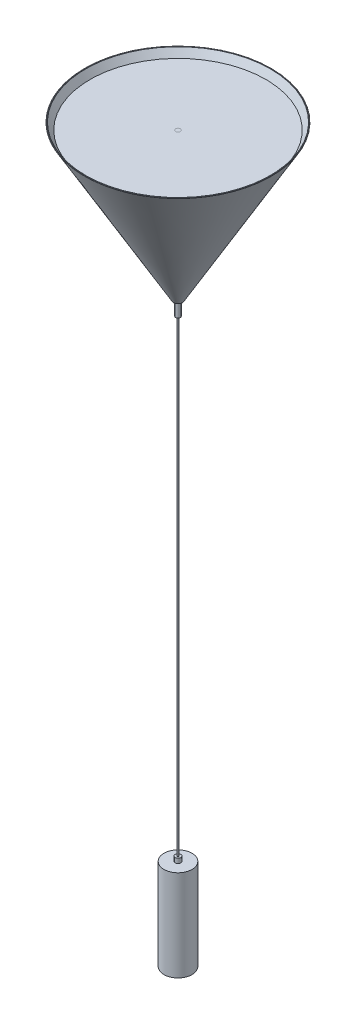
ISO-10303-21;
HEADER;
FILE_DESCRIPTION(('STEP AP214'),'2;1');
FILE_NAME('part.step','',(''),(''),'','','');
FILE_SCHEMA(('AUTOMOTIVE_DESIGN { 1 0 10303 214 1 1 1 1 }'));
ENDSEC;
DATA;
#1=APPLICATION_CONTEXT('core data for automotive mechanical design processes');
#2=APPLICATION_PROTOCOL_DEFINITION('international standard','automotive_design',2000,#1);
#3=PRODUCT_CONTEXT('',#1,'mechanical');
#4=PRODUCT('Part','Part','',(#3));
#5=PRODUCT_RELATED_PRODUCT_CATEGORY('part','',(#4));
#6=PRODUCT_DEFINITION_FORMATION('','',#4);
#7=PRODUCT_DEFINITION_CONTEXT('part definition',#1,'design');
#8=PRODUCT_DEFINITION('design','',#6,#7);
#9=PRODUCT_DEFINITION_SHAPE('','',#8);
#10=(LENGTH_UNIT() NAMED_UNIT(*) SI_UNIT(.MILLI.,.METRE.));
#11=(NAMED_UNIT(*) PLANE_ANGLE_UNIT() SI_UNIT($,.RADIAN.));
#12=(NAMED_UNIT(*) SI_UNIT($,.STERADIAN.) SOLID_ANGLE_UNIT());
#13=UNCERTAINTY_MEASURE_WITH_UNIT(LENGTH_MEASURE(1.E-05),#10,'distance_accuracy_value','');
#14=(GEOMETRIC_REPRESENTATION_CONTEXT(3) GLOBAL_UNCERTAINTY_ASSIGNED_CONTEXT((#13)) GLOBAL_UNIT_ASSIGNED_CONTEXT((#10,
#11,#12)) REPRESENTATION_CONTEXT('',''));
#15=CARTESIAN_POINT('',(0.,0.,0.));
#16=DIRECTION('',(0.,0.,1.));
#17=DIRECTION('',(1.,0.,0.));
#18=AXIS2_PLACEMENT_3D('',#15,#16,#17);
#19=CARTESIAN_POINT('',(-136.005486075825,491.550601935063,408.036497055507));
#20=DIRECTION('',(0.,1.,0.));
#21=DIRECTION('',(0.837169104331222,0.,0.546944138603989));
#22=AXIS2_PLACEMENT_3D('',#19,#20,#21);
#23=PLANE('',#22);
#24=CARTESIAN_POINT('',(-136.005486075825,491.550601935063,408.036497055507));
#25=DIRECTION('',(0.,1.,0.));
#26=DIRECTION('',(0.837169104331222,0.,0.546944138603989));
#27=AXIS2_PLACEMENT_3D('',#24,#25,#26);
#28=CIRCLE('',#27,186.845299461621);
#29=CARTESIAN_POINT('',(20.4156259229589,491.550601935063,510.230438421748));
#30=VERTEX_POINT('',#29);
#31=EDGE_CURVE('P0_E10',#30,#30,#28,.T.);
#32=ORIENTED_EDGE('',*,*,#31,.F.);
#33=EDGE_LOOP('',(#32));
#34=FACE_BOUND('',#33,.T.);
#35=ADVANCED_FACE('P0_F15',(#34),#23,.F.);
#36=CARTESIAN_POINT('',(-136.005486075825,491.550601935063,408.036497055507));
#37=DIRECTION('',(0.,1.,0.));
#38=DIRECTION('',(0.837169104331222,0.,0.546944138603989));
#39=AXIS2_PLACEMENT_3D('',#36,#37,#38);
#40=CONICAL_SURFACE('',#39,186.845299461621,0.523598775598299);
#41=CARTESIAN_POINT('',(-136.005486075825,493.550601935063,408.036497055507));
#42=DIRECTION('',(0.,1.,0.));
#43=DIRECTION('',(0.837169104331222,0.,0.546944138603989));
#44=AXIS2_PLACEMENT_3D('',#41,#42,#43);
#45=CIRCLE('',#44,188.);
#46=CARTESIAN_POINT('',(21.3823055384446,493.550601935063,510.861995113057));
#47=VERTEX_POINT('',#46);
#48=EDGE_CURVE('P0_E21',#47,#47,#45,.T.);
#49=ORIENTED_EDGE('',*,*,#48,.F.);
#50=EDGE_LOOP('',(#49));
#51=FACE_BOUND('',#50,.T.);
#52=ORIENTED_EDGE('',*,*,#31,.T.);
#53=EDGE_LOOP('',(#52));
#54=FACE_BOUND('',#53,.T.);
#55=ADVANCED_FACE('P0_F29',(#51,#54),#40,.T.);
#56=CARTESIAN_POINT('',(-293.393277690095,493.550601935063,305.210998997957));
#57=DIRECTION('',(0.,-1.,0.));
#58=DIRECTION('',(-0.837169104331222,0.,-0.546944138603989));
#59=AXIS2_PLACEMENT_3D('',#56,#57,#58);
#60=PLANE('',#59);
#61=ORIENTED_EDGE('',*,*,#48,.T.);
#62=EDGE_LOOP('',(#61));
#63=FACE_BOUND('',#62,.T.);
#64=ADVANCED_FACE('P0_F27',(#63),#60,.F.);
#65=CLOSED_SHELL('',(#35,#55,#64));
#66=MANIFOLD_SOLID_BREP('P0_B1',#65);
#67=CARTESIAN_POINT('',(-136.005486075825,148.636246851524,408.036497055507));
#68=DIRECTION('',(0.,1.,0.));
#69=DIRECTION('',(-0.546944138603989,0.,0.837169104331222));
#70=AXIS2_PLACEMENT_3D('',#67,#68,#69);
#71=CYLINDRICAL_SURFACE('',#70,5.);
#72=CARTESIAN_POINT('',(-136.005486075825,148.636246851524,408.036497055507));
#73=DIRECTION('',(0.,-1.,0.));
#74=DIRECTION('',(0.546944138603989,0.,-0.837169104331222));
#75=AXIS2_PLACEMENT_3D('',#72,#73,#74);
#76=CIRCLE('',#75,5.);
#77=CARTESIAN_POINT('',(-133.270765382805,148.636246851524,403.850651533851));
#78=VERTEX_POINT('',#77);
#79=EDGE_CURVE('P1_E10',#78,#78,#76,.T.);
#80=ORIENTED_EDGE('',*,*,#79,.F.);
#81=EDGE_LOOP('',(#80));
#82=FACE_BOUND('',#81,.T.);
#83=CARTESIAN_POINT('',(-136.005486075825,178.636246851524,408.036497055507));
#84=DIRECTION('',(0.,-1.,0.));
#85=DIRECTION('',(0.546944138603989,0.,-0.837169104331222));
#86=AXIS2_PLACEMENT_3D('',#83,#84,#85);
#87=CIRCLE('',#86,5.);
#88=CARTESIAN_POINT('',(-133.270765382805,178.636246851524,403.850651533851));
#89=VERTEX_POINT('',#88);
#90=EDGE_CURVE('P1_E18',#89,#89,#87,.T.);
#91=ORIENTED_EDGE('',*,*,#90,.T.);
#92=EDGE_LOOP('',(#91));
#93=FACE_BOUND('',#92,.T.);
#94=ADVANCED_FACE('P1_F15',(#82,#93),#71,.T.);
#95=CARTESIAN_POINT('',(-136.005486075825,148.636246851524,408.036497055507));
#96=DIRECTION('',(0.,-1.,0.));
#97=DIRECTION('',(0.546944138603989,0.,-0.837169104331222));
#98=AXIS2_PLACEMENT_3D('',#95,#96,#97);
#99=PLANE('',#98);
#100=ORIENTED_EDGE('',*,*,#79,.T.);
#101=EDGE_LOOP('',(#100));
#102=FACE_BOUND('',#101,.T.);
#103=ADVANCED_FACE('P1_F30',(#102),#99,.T.);
#104=CARTESIAN_POINT('',(-136.005486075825,178.636246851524,408.036497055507));
#105=DIRECTION('',(0.,-1.,0.));
#106=DIRECTION('',(0.546944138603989,0.,-0.837169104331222));
#107=AXIS2_PLACEMENT_3D('',#104,#105,#106);
#108=PLANE('',#107);
#109=ORIENTED_EDGE('',*,*,#90,.F.);
#110=EDGE_LOOP('',(#109));
#111=FACE_BOUND('',#110,.T.);
#112=ADVANCED_FACE('P1_F28',(#111),#108,.F.);
#113=CLOSED_SHELL('',(#94,#103,#112));
#114=MANIFOLD_SOLID_BREP('P1_B1',#113);
#115=CARTESIAN_POINT('',(-136.005486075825,178.636246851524,408.036497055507));
#116=DIRECTION('',(0.,1.,0.));
#117=DIRECTION('',(-0.546944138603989,0.,0.837169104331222));
#118=AXIS2_PLACEMENT_3D('',#115,#116,#117);
#119=PLANE('',#118);
#120=CARTESIAN_POINT('',(-136.005486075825,178.636246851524,408.036497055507));
#121=DIRECTION('',(0.,1.,0.));
#122=DIRECTION('',(-0.546944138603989,0.,0.837169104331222));
#123=AXIS2_PLACEMENT_3D('',#120,#121,#122);
#124=CIRCLE('',#123,9.52385828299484);
#125=CARTESIAN_POINT('',(-141.214504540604,178.636246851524,416.00957696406));
#126=VERTEX_POINT('',#125);
#127=EDGE_CURVE('P2_E35',#126,#126,#124,.T.);
#128=ORIENTED_EDGE('',*,*,#127,.F.);
#129=EDGE_LOOP('',(#128));
#130=FACE_BOUND('',#129,.T.);
#131=ADVANCED_FACE('P2_F15',(#130),#119,.F.);
#132=CARTESIAN_POINT('',(-136.005486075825,178.636246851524,408.036497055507));
#133=DIRECTION('',(0.,1.,0.));
#134=DIRECTION('',(-0.546944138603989,0.,0.837169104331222));
#135=AXIS2_PLACEMENT_3D('',#132,#133,#134);
#136=CONICAL_SURFACE('',#135,9.52385828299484,0.523598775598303);
#137=CARTESIAN_POINT('',(-136.005486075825,507.800601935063,408.036497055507));
#138=DIRECTION('',(0.,-1.,0.));
#139=DIRECTION('',(0.546944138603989,0.,-0.837169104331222));
#140=AXIS2_PLACEMENT_3D('',#137,#138,#139);
#141=CIRCLE('',#140,199.566987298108);
#142=CARTESIAN_POINT('',(-245.157480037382,507.800601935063,575.107813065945));
#143=VERTEX_POINT('',#142);
#144=EDGE_CURVE('P2_E22',#143,#143,#141,.T.);
#145=CARTESIAN_POINT('',(-245.157480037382,507.800601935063,575.107813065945));
#146=CARTESIAN_POINT('',(-244.07474070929,504.37180656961,573.450539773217));
#147=CARTESIAN_POINT('',(-242.992001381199,500.943011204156,571.793266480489));
#148=CARTESIAN_POINT('',(-240.826522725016,494.085420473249,568.478719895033));
#149=CARTESIAN_POINT('',(-239.743783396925,490.656625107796,566.821446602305));
#150=CARTESIAN_POINT('',(-237.578304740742,483.799034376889,563.506900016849));
#151=CARTESIAN_POINT('',(-236.49556541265,480.370239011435,561.849626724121));
#152=CARTESIAN_POINT('',(-234.330086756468,473.512648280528,558.535080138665));
#153=CARTESIAN_POINT('',(-233.247347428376,470.083852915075,556.877806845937));
#154=CARTESIAN_POINT('',(-231.081868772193,463.226262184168,553.563260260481));
#155=CARTESIAN_POINT('',(-229.999129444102,459.797466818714,551.905986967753));
#156=CARTESIAN_POINT('',(-227.833650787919,452.939876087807,548.591440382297));
#157=CARTESIAN_POINT('',(-226.750911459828,449.511080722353,546.934167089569));
#158=CARTESIAN_POINT('',(-224.585432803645,442.653489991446,543.619620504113));
#159=CARTESIAN_POINT('',(-223.502693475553,439.224694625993,541.962347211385));
#160=CARTESIAN_POINT('',(-221.33721481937,432.367103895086,538.647800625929));
#161=CARTESIAN_POINT('',(-220.254475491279,428.938308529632,536.990527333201));
#162=CARTESIAN_POINT('',(-218.088996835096,422.080717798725,533.675980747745));
#163=CARTESIAN_POINT('',(-217.006257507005,418.651922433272,532.018707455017));
#164=CARTESIAN_POINT('',(-214.840778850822,411.794331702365,528.704160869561));
#165=CARTESIAN_POINT('',(-213.75803952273,408.365536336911,527.046887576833));
#166=CARTESIAN_POINT('',(-211.592560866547,401.507945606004,523.732340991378));
#167=CARTESIAN_POINT('',(-210.509821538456,398.07915024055,522.075067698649));
#168=CARTESIAN_POINT('',(-208.344342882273,391.221559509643,518.760521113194));
#169=CARTESIAN_POINT('',(-207.261603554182,387.79276414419,517.103247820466));
#170=CARTESIAN_POINT('',(-205.096124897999,380.935173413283,513.78870123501));
#171=CARTESIAN_POINT('',(-204.013385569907,377.506378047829,512.131427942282));
#172=CARTESIAN_POINT('',(-201.847906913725,370.648787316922,508.816881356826));
#173=CARTESIAN_POINT('',(-200.765167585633,367.219991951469,507.159608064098));
#174=CARTESIAN_POINT('',(-198.59968892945,360.362401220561,503.845061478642));
#175=CARTESIAN_POINT('',(-197.516949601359,356.933605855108,502.187788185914));
#176=CARTESIAN_POINT('',(-195.351470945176,350.076015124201,498.873241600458));
#177=CARTESIAN_POINT('',(-194.268731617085,346.647219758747,497.21596830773));
#178=CARTESIAN_POINT('',(-192.103252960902,339.78962902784,493.901421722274));
#179=CARTESIAN_POINT('',(-191.02051363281,336.360833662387,492.244148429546));
#180=CARTESIAN_POINT('',(-188.855034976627,329.50324293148,488.92960184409));
#181=CARTESIAN_POINT('',(-187.772295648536,326.074447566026,487.272328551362));
#182=CARTESIAN_POINT('',(-185.606816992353,319.216856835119,483.957781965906));
#183=CARTESIAN_POINT('',(-184.524077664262,315.788061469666,482.300508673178));
#184=CARTESIAN_POINT('',(-182.358599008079,308.930470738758,478.985962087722));
#185=CARTESIAN_POINT('',(-181.275859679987,305.501675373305,477.328688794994));
#186=CARTESIAN_POINT('',(-179.110381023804,298.644084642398,474.014142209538));
#187=CARTESIAN_POINT('',(-178.027641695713,295.215289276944,472.356868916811));
#188=CARTESIAN_POINT('',(-175.86216303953,288.357698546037,469.042322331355));
#189=CARTESIAN_POINT('',(-174.779423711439,284.928903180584,467.385049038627));
#190=CARTESIAN_POINT('',(-172.613945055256,278.071312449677,464.070502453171));
#191=CARTESIAN_POINT('',(-171.531205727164,274.642517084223,462.413229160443));
#192=CARTESIAN_POINT('',(-169.365727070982,267.784926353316,459.098682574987));
#193=CARTESIAN_POINT('',(-168.28298774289,264.356130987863,457.441409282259));
#194=CARTESIAN_POINT('',(-166.117509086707,257.498540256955,454.126862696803));
#195=CARTESIAN_POINT('',(-165.034769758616,254.069744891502,452.469589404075));
#196=CARTESIAN_POINT('',(-162.869291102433,247.212154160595,449.155042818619));
#197=CARTESIAN_POINT('',(-161.786551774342,243.783358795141,447.497769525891));
#198=CARTESIAN_POINT('',(-159.621073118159,236.925768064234,444.183222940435));
#199=CARTESIAN_POINT('',(-158.538333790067,233.496972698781,442.525949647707));
#200=CARTESIAN_POINT('',(-156.372855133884,226.639381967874,439.211403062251));
#201=CARTESIAN_POINT('',(-155.290115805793,223.21058660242,437.554129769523));
#202=CARTESIAN_POINT('',(-153.12463714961,216.352995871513,434.239583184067));
#203=CARTESIAN_POINT('',(-152.041897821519,212.924200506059,432.582309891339));
#204=CARTESIAN_POINT('',(-149.876419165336,206.066609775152,429.267763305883));
#205=CARTESIAN_POINT('',(-148.793679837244,202.637814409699,427.610490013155));
#206=CARTESIAN_POINT('',(-146.628201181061,195.780223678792,424.295943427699));
#207=CARTESIAN_POINT('',(-145.54546185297,192.351428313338,422.638670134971));
#208=CARTESIAN_POINT('',(-143.379983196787,185.493837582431,419.324123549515));
#209=CARTESIAN_POINT('',(-142.297243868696,182.065042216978,417.666850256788));
#210=CARTESIAN_POINT('',(-141.214504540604,178.636246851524,416.00957696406));
#211=B_SPLINE_CURVE_WITH_KNOTS('',3,(#145,#146,#147,#148,#149,#150,#151,#152,#153,#154,#155,
#156,#157,#158,#159,#160,#161,#162,#163,#164,#165,#166,#167,#168,#169,#170,#171,#172,#173,#174,
#175,#176,#177,#178,#179,#180,#181,#182,#183,#184,#185,#186,#187,#188,#189,#190,#191,#192,#193,
#194,#195,#196,#197,#198,#199,#200,#201,#202,#203,#204,#205,#206,#207,#208,#209,#210),
.UNSPECIFIED.,.F.,.F.,(4,2,2,2,2,2,2,2,2,2,2,2,2,2,2,2,2,2,2,2,2,2,2,2,2,2,2,2,2,2,2,2,4),(0.,
11.8776955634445,23.7553911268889,35.6330866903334,47.5107822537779,59.3884778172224,
71.2661733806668,83.1438689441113,95.0215645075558,106.899260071,118.776955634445,
130.654651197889,142.532346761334,154.410042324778,166.287737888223,178.165433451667,
190.043129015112,201.920824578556,213.798520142,225.676215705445,237.553911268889,
249.431606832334,261.309302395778,273.186997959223,285.064693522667,296.942389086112,
308.820084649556,320.697780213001,332.575475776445,344.45317133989,356.330866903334,
368.208562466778,380.086258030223),.UNSPECIFIED.);
#212=EDGE_CURVE('P2_BSEAM58',#143,#126,#211,.T.);
#213=ORIENTED_EDGE('',*,*,#144,.T.);
#214=ORIENTED_EDGE('',*,*,#127,.T.);
#215=ORIENTED_EDGE('',*,*,#212,.T.);
#216=ORIENTED_EDGE('',*,*,#212,.F.);
#217=EDGE_LOOP('',(#213,#215,#214,#216));
#218=FACE_BOUND('',#217,.T.);
#219=ADVANCED_FACE('P2_F58',(#218),#136,.T.);
#220=CARTESIAN_POINT('',(-136.005486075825,508.550601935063,408.036497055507));
#221=DIRECTION('',(0.,-1.,0.));
#222=DIRECTION('',(0.546944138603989,0.,-0.837169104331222));
#223=AXIS2_PLACEMENT_3D('',#220,#221,#222);
#224=PLANE('',#223);
#225=CARTESIAN_POINT('',(-136.005486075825,508.550601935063,408.036497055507));
#226=DIRECTION('',(0.,-1.,0.));
#227=DIRECTION('',(0.546944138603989,0.,-0.837169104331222));
#228=AXIS2_PLACEMENT_3D('',#225,#226,#227);
#229=CIRCLE('',#228,199.133974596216);
#230=CARTESIAN_POINT('',(-27.0903258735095,508.550601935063,241.327685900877));
#231=VERTEX_POINT('',#230);
#232=EDGE_CURVE('P2_E26',#231,#231,#229,.F.);
#233=ORIENTED_EDGE('',*,*,#232,.T.);
#234=EDGE_LOOP('',(#233));
#235=FACE_BOUND('',#234,.T.);
#236=CARTESIAN_POINT('',(-136.005486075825,508.550601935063,408.036497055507));
#237=DIRECTION('',(0.,-1.,0.));
#238=DIRECTION('',(0.546944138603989,0.,-0.837169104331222));
#239=AXIS2_PLACEMENT_3D('',#236,#237,#238);
#240=CIRCLE('',#239,197.979274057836);
#241=CARTESIAN_POINT('',(-27.7218825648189,508.550601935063,242.294365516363));
#242=VERTEX_POINT('',#241);
#243=EDGE_CURVE('P2_E30',#242,#242,#240,.T.);
#244=ORIENTED_EDGE('',*,*,#243,.T.);
#245=EDGE_LOOP('',(#244));
#246=FACE_BOUND('',#245,.T.);
#247=ADVANCED_FACE('P2_F54',(#235,#246),#224,.F.);
#248=CARTESIAN_POINT('',(-136.005486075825,180.636246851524,408.036497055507));
#249=DIRECTION('',(0.,1.,0.));
#250=DIRECTION('',(-0.546944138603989,0.,0.837169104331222));
#251=AXIS2_PLACEMENT_3D('',#248,#249,#250);
#252=PLANE('',#251);
#253=CARTESIAN_POINT('',(-136.005486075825,180.636246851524,408.036497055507));
#254=DIRECTION('',(0.,1.,0.));
#255=DIRECTION('',(-0.546944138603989,0.,0.837169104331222));
#256=AXIS2_PLACEMENT_3D('',#253,#254,#255);
#257=CIRCLE('',#256,8.3691577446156);
#258=CARTESIAN_POINT('',(-140.582947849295,180.636246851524,415.042897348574));
#259=VERTEX_POINT('',#258);
#260=EDGE_CURVE('P2_E38',#259,#259,#257,.T.);
#261=ORIENTED_EDGE('',*,*,#260,.T.);
#262=EDGE_LOOP('',(#261));
#263=FACE_BOUND('',#262,.T.);
#264=ADVANCED_FACE('P2_F42',(#263),#252,.T.);
#265=CARTESIAN_POINT('',(-136.005486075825,179.636246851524,408.036497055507));
#266=DIRECTION('',(0.,1.,0.));
#267=DIRECTION('',(-0.546944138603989,0.,0.837169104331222));
#268=AXIS2_PLACEMENT_3D('',#265,#266,#267);
#269=CONICAL_SURFACE('',#268,7.79180747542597,0.523598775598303);
#270=CARTESIAN_POINT('',(-136.005486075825,508.300601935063,408.036497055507));
#271=DIRECTION('',(0.,1.,0.));
#272=DIRECTION('',(-0.546944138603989,0.,0.837169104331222));
#273=AXIS2_PLACEMENT_3D('',#270,#271,#272);
#274=CIRCLE('',#273,197.546261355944);
#275=CARTESIAN_POINT('',(-244.05225582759,508.300601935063,573.416123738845));
#276=VERTEX_POINT('',#275);
#277=EDGE_CURVE('P2_E10',#276,#276,#274,.T.);
#278=CARTESIAN_POINT('',(-244.05225582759,508.300601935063,573.416123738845));
#279=CARTESIAN_POINT('',(-242.97445053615,504.88743156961,571.766402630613));
#280=CARTESIAN_POINT('',(-241.896645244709,501.474261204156,570.116681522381));
#281=CARTESIAN_POINT('',(-239.741034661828,494.647920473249,566.817239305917));
#282=CARTESIAN_POINT('',(-238.663229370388,491.234750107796,565.167518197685));
#283=CARTESIAN_POINT('',(-236.507618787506,484.408409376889,561.868075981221));
#284=CARTESIAN_POINT('',(-235.429813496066,480.995239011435,560.218354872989));
#285=CARTESIAN_POINT('',(-233.274202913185,474.168898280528,556.918912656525));
#286=CARTESIAN_POINT('',(-232.196397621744,470.755727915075,555.269191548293));
#287=CARTESIAN_POINT('',(-230.040787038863,463.929387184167,551.969749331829));
#288=CARTESIAN_POINT('',(-228.962981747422,460.516216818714,550.320028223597));
#289=CARTESIAN_POINT('',(-226.807371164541,453.689876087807,547.020586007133));
#290=CARTESIAN_POINT('',(-225.729565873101,450.276705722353,545.370864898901));
#291=CARTESIAN_POINT('',(-223.573955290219,443.450364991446,542.071422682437));
#292=CARTESIAN_POINT('',(-222.496149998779,440.037194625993,540.421701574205));
#293=CARTESIAN_POINT('',(-220.340539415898,433.210853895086,537.122259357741));
#294=CARTESIAN_POINT('',(-219.262734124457,429.797683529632,535.472538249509));
#295=CARTESIAN_POINT('',(-217.107123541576,422.971342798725,532.173096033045));
#296=CARTESIAN_POINT('',(-216.029318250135,419.558172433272,530.523374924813));
#297=CARTESIAN_POINT('',(-213.873707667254,412.731831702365,527.223932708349));
#298=CARTESIAN_POINT('',(-212.795902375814,409.318661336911,525.574211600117));
#299=CARTESIAN_POINT('',(-210.640291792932,402.492320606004,522.274769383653));
#300=CARTESIAN_POINT('',(-209.562486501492,399.07915024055,520.625048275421));
#301=CARTESIAN_POINT('',(-207.406875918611,392.252809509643,517.325606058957));
#302=CARTESIAN_POINT('',(-206.32907062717,388.83963914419,515.675884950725));
#303=CARTESIAN_POINT('',(-204.173460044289,382.013298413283,512.376442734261));
#304=CARTESIAN_POINT('',(-203.095654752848,378.600128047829,510.726721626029));
#305=CARTESIAN_POINT('',(-200.940044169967,371.773787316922,507.427279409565));
#306=CARTESIAN_POINT('',(-199.862238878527,368.360616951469,505.777558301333));
#307=CARTESIAN_POINT('',(-197.706628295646,361.534276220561,502.478116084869));
#308=CARTESIAN_POINT('',(-196.628823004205,358.121105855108,500.828394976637));
#309=CARTESIAN_POINT('',(-194.473212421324,351.294765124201,497.528952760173));
#310=CARTESIAN_POINT('',(-193.395407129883,347.881594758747,495.879231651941));
#311=CARTESIAN_POINT('',(-191.239796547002,341.05525402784,492.579789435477));
#312=CARTESIAN_POINT('',(-190.161991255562,337.642083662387,490.930068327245));
#313=CARTESIAN_POINT('',(-188.00638067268,330.81574293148,487.630626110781));
#314=CARTESIAN_POINT('',(-186.92857538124,327.402572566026,485.980905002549));
#315=CARTESIAN_POINT('',(-184.772964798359,320.576231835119,482.681462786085));
#316=CARTESIAN_POINT('',(-183.695159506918,317.163061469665,481.031741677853));
#317=CARTESIAN_POINT('',(-181.539548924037,310.336720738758,477.732299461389));
#318=CARTESIAN_POINT('',(-180.461743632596,306.923550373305,476.082578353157));
#319=CARTESIAN_POINT('',(-178.306133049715,300.097209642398,472.783136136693));
#320=CARTESIAN_POINT('',(-177.228327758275,296.684039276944,471.133415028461));
#321=CARTESIAN_POINT('',(-175.072717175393,289.857698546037,467.833972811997));
#322=CARTESIAN_POINT('',(-173.994911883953,286.444528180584,466.184251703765));
#323=CARTESIAN_POINT('',(-171.839301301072,279.618187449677,462.884809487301));
#324=CARTESIAN_POINT('',(-170.761496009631,276.205017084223,461.235088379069));
#325=CARTESIAN_POINT('',(-168.60588542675,269.378676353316,457.935646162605));
#326=CARTESIAN_POINT('',(-167.528080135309,265.965505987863,456.285925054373));
#327=CARTESIAN_POINT('',(-165.372469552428,259.139165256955,452.98648283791));
#328=CARTESIAN_POINT('',(-164.294664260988,255.725994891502,451.336761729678));
#329=CARTESIAN_POINT('',(-162.139053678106,248.899654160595,448.037319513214));
#330=CARTESIAN_POINT('',(-161.061248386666,245.486483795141,446.387598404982));
#331=CARTESIAN_POINT('',(-158.905637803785,238.660143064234,443.088156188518));
#332=CARTESIAN_POINT('',(-157.827832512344,235.246972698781,441.438435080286));
#333=CARTESIAN_POINT('',(-155.672221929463,228.420631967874,438.138992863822));
#334=CARTESIAN_POINT('',(-154.594416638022,225.00746160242,436.48927175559));
#335=CARTESIAN_POINT('',(-152.438806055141,218.181120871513,433.189829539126));
#336=CARTESIAN_POINT('',(-151.361000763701,214.767950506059,431.540108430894));
#337=CARTESIAN_POINT('',(-149.205390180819,207.941609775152,428.24066621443));
#338=CARTESIAN_POINT('',(-148.127584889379,204.528439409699,426.590945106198));
#339=CARTESIAN_POINT('',(-145.971974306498,197.702098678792,423.291502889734));
#340=CARTESIAN_POINT('',(-144.894169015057,194.288928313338,421.641781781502));
#341=CARTESIAN_POINT('',(-142.738558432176,187.462587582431,418.342339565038));
#342=CARTESIAN_POINT('',(-141.660753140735,184.049417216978,416.692618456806));
#343=CARTESIAN_POINT('',(-140.582947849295,180.636246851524,415.042897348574));
#344=B_SPLINE_CURVE_WITH_KNOTS('',3,(#278,#279,#280,#281,#282,#283,#284,#285,#286,#287,#288,
#289,#290,#291,#292,#293,#294,#295,#296,#297,#298,#299,#300,#301,#302,#303,#304,#305,#306,#307,
#308,#309,#310,#311,#312,#313,#314,#315,#316,#317,#318,#319,#320,#321,#322,#323,#324,#325,#326,
#327,#328,#329,#330,#331,#332,#333,#334,#335,#336,#337,#338,#339,#340,#341,#342,#343),
.UNSPECIFIED.,.F.,.F.,(4,2,2,2,2,2,2,2,2,2,2,2,2,2,2,2,2,2,2,2,2,2,2,2,2,2,2,2,2,2,2,2,4),(0.,
11.823568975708,23.6471379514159,35.4707069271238,47.2942759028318,59.1178448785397,
70.9414138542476,82.7649828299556,94.5885518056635,106.412120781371,118.235689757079,
130.059258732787,141.882827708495,153.706396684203,165.529965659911,177.353534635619,
189.177103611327,201.000672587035,212.824241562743,224.647810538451,236.471379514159,
248.294948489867,260.118517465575,271.942086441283,283.765655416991,295.589224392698,
307.412793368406,319.236362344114,331.059931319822,342.88350029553,354.707069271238,
366.530638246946,378.354207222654),.UNSPECIFIED.);
#345=EDGE_CURVE('P2_BSEAM44',#276,#259,#344,.T.);
#346=ORIENTED_EDGE('',*,*,#277,.T.);
#347=ORIENTED_EDGE('',*,*,#260,.F.);
#348=ORIENTED_EDGE('',*,*,#345,.T.);
#349=ORIENTED_EDGE('',*,*,#345,.F.);
#350=EDGE_LOOP('',(#346,#348,#347,#349));
#351=FACE_BOUND('',#350,.T.);
#352=ADVANCED_FACE('P2_F44',(#351),#269,.F.);
#353=CARTESIAN_POINT('',(-136.005486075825,508.050601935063,408.036497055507));
#354=DIRECTION('',(0.,-1.,0.));
#355=DIRECTION('',(0.546944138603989,0.,-0.837169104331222));
#356=AXIS2_PLACEMENT_3D('',#353,#354,#355);
#357=TOROIDAL_SURFACE('',#356,199.133974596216,0.5);
#358=ORIENTED_EDGE('',*,*,#144,.F.);
#359=EDGE_LOOP('',(#358));
#360=FACE_BOUND('',#359,.T.);
#361=ORIENTED_EDGE('',*,*,#232,.F.);
#362=EDGE_LOOP('',(#361));
#363=FACE_BOUND('',#362,.T.);
#364=ADVANCED_FACE('P2_F46',(#360,#363),#357,.T.);
#365=CARTESIAN_POINT('',(-136.005486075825,508.050601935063,408.036497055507));
#366=DIRECTION('',(0.,-1.,0.));
#367=DIRECTION('',(0.546944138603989,0.,-0.837169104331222));
#368=AXIS2_PLACEMENT_3D('',#365,#366,#367);
#369=TOROIDAL_SURFACE('',#368,197.979274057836,0.5);
#370=ORIENTED_EDGE('',*,*,#243,.F.);
#371=EDGE_LOOP('',(#370));
#372=FACE_BOUND('',#371,.T.);
#373=ORIENTED_EDGE('',*,*,#277,.F.);
#374=EDGE_LOOP('',(#373));
#375=FACE_BOUND('',#374,.T.);
#376=ADVANCED_FACE('P2_F17',(#372,#375),#369,.T.);
#377=CLOSED_SHELL('',(#131,#219,#247,#264,#352,#364,#376));
#378=MANIFOLD_SOLID_BREP('P2_B1',#377);
#379=CARTESIAN_POINT('',(-136.005486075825,493.560601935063,408.036497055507));
#380=DIRECTION('',(0.,-1.,0.));
#381=DIRECTION('',(-0.837169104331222,0.,-0.546944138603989));
#382=AXIS2_PLACEMENT_3D('',#379,#380,#381);
#383=CYLINDRICAL_SURFACE('',#382,5.);
#384=CARTESIAN_POINT('',(-136.005486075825,493.560601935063,408.036497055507));
#385=DIRECTION('',(0.,1.,0.));
#386=DIRECTION('',(0.837169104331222,0.,0.546944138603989));
#387=AXIS2_PLACEMENT_3D('',#384,#385,#386);
#388=CIRCLE('',#387,5.);
#389=CARTESIAN_POINT('',(-140.191331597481,493.560601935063,405.301776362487));
#390=VERTEX_POINT('',#389);
#391=EDGE_CURVE('P3_E9',#390,#390,#388,.T.);
#392=CARTESIAN_POINT('',(-136.005486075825,493.550601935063,408.036497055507));
#393=DIRECTION('',(0.,1.,0.));
#394=DIRECTION('',(0.837169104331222,0.,0.546944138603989));
#395=AXIS2_PLACEMENT_3D('',#392,#393,#394);
#396=CIRCLE('',#395,5.);
#397=CARTESIAN_POINT('',(-140.191331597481,493.550601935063,405.301776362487));
#398=VERTEX_POINT('',#397);
#399=EDGE_CURVE('P3_E17',#398,#398,#396,.T.);
#400=CARTESIAN_POINT('',(-140.191331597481,493.560601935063,405.301776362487));
#401=CARTESIAN_POINT('',(-140.191331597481,493.560497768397,405.301776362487));
#402=CARTESIAN_POINT('',(-140.191331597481,493.56039360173,405.301776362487));
#403=CARTESIAN_POINT('',(-140.191331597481,493.560185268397,405.301776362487));
#404=CARTESIAN_POINT('',(-140.191331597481,493.56008110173,405.301776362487));
#405=CARTESIAN_POINT('',(-140.191331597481,493.559872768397,405.301776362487));
#406=CARTESIAN_POINT('',(-140.191331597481,493.55976860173,405.301776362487));
#407=CARTESIAN_POINT('',(-140.191331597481,493.559560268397,405.301776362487));
#408=CARTESIAN_POINT('',(-140.191331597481,493.55945610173,405.301776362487));
#409=CARTESIAN_POINT('',(-140.191331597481,493.559247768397,405.301776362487));
#410=CARTESIAN_POINT('',(-140.191331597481,493.55914360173,405.301776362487));
#411=CARTESIAN_POINT('',(-140.191331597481,493.558935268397,405.301776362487));
#412=CARTESIAN_POINT('',(-140.191331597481,493.55883110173,405.301776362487));
#413=CARTESIAN_POINT('',(-140.191331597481,493.558622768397,405.301776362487));
#414=CARTESIAN_POINT('',(-140.191331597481,493.55851860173,405.301776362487));
#415=CARTESIAN_POINT('',(-140.191331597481,493.558310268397,405.301776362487));
#416=CARTESIAN_POINT('',(-140.191331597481,493.55820610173,405.301776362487));
#417=CARTESIAN_POINT('',(-140.191331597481,493.557997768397,405.301776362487));
#418=CARTESIAN_POINT('',(-140.191331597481,493.55789360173,405.301776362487));
#419=CARTESIAN_POINT('',(-140.191331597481,493.557685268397,405.301776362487));
#420=CARTESIAN_POINT('',(-140.191331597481,493.55758110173,405.301776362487));
#421=CARTESIAN_POINT('',(-140.191331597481,493.557372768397,405.301776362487));
#422=CARTESIAN_POINT('',(-140.191331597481,493.55726860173,405.301776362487));
#423=CARTESIAN_POINT('',(-140.191331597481,493.557060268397,405.301776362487));
#424=CARTESIAN_POINT('',(-140.191331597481,493.55695610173,405.301776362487));
#425=CARTESIAN_POINT('',(-140.191331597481,493.556747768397,405.301776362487));
#426=CARTESIAN_POINT('',(-140.191331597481,493.55664360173,405.301776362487));
#427=CARTESIAN_POINT('',(-140.191331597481,493.556435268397,405.301776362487));
#428=CARTESIAN_POINT('',(-140.191331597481,493.55633110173,405.301776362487));
#429=CARTESIAN_POINT('',(-140.191331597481,493.556122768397,405.301776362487));
#430=CARTESIAN_POINT('',(-140.191331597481,493.55601860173,405.301776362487));
#431=CARTESIAN_POINT('',(-140.191331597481,493.555810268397,405.301776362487));
#432=CARTESIAN_POINT('',(-140.191331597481,493.55570610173,405.301776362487));
#433=CARTESIAN_POINT('',(-140.191331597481,493.555497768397,405.301776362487));
#434=CARTESIAN_POINT('',(-140.191331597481,493.55539360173,405.301776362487));
#435=CARTESIAN_POINT('',(-140.191331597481,493.555185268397,405.301776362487));
#436=CARTESIAN_POINT('',(-140.191331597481,493.55508110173,405.301776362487));
#437=CARTESIAN_POINT('',(-140.191331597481,493.554872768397,405.301776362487));
#438=CARTESIAN_POINT('',(-140.191331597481,493.55476860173,405.301776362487));
#439=CARTESIAN_POINT('',(-140.191331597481,493.554560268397,405.301776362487));
#440=CARTESIAN_POINT('',(-140.191331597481,493.55445610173,405.301776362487));
#441=CARTESIAN_POINT('',(-140.191331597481,493.554247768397,405.301776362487));
#442=CARTESIAN_POINT('',(-140.191331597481,493.55414360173,405.301776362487));
#443=CARTESIAN_POINT('',(-140.191331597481,493.553935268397,405.301776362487));
#444=CARTESIAN_POINT('',(-140.191331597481,493.55383110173,405.301776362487));
#445=CARTESIAN_POINT('',(-140.191331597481,493.553622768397,405.301776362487));
#446=CARTESIAN_POINT('',(-140.191331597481,493.55351860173,405.301776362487));
#447=CARTESIAN_POINT('',(-140.191331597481,493.553310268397,405.301776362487));
#448=CARTESIAN_POINT('',(-140.191331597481,493.55320610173,405.301776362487));
#449=CARTESIAN_POINT('',(-140.191331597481,493.552997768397,405.301776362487));
#450=CARTESIAN_POINT('',(-140.191331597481,493.55289360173,405.301776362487));
#451=CARTESIAN_POINT('',(-140.191331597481,493.552685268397,405.301776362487));
#452=CARTESIAN_POINT('',(-140.191331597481,493.55258110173,405.301776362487));
#453=CARTESIAN_POINT('',(-140.191331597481,493.552372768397,405.301776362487));
#454=CARTESIAN_POINT('',(-140.191331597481,493.55226860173,405.301776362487));
#455=CARTESIAN_POINT('',(-140.191331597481,493.552060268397,405.301776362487));
#456=CARTESIAN_POINT('',(-140.191331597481,493.55195610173,405.301776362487));
#457=CARTESIAN_POINT('',(-140.191331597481,493.551747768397,405.301776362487));
#458=CARTESIAN_POINT('',(-140.191331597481,493.55164360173,405.301776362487));
#459=CARTESIAN_POINT('',(-140.191331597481,493.551435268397,405.301776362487));
#460=CARTESIAN_POINT('',(-140.191331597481,493.55133110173,405.301776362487));
#461=CARTESIAN_POINT('',(-140.191331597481,493.551122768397,405.301776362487));
#462=CARTESIAN_POINT('',(-140.191331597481,493.55101860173,405.301776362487));
#463=CARTESIAN_POINT('',(-140.191331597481,493.550810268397,405.301776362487));
#464=CARTESIAN_POINT('',(-140.191331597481,493.55070610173,405.301776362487));
#465=CARTESIAN_POINT('',(-140.191331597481,493.550601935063,405.301776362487));
#466=B_SPLINE_CURVE_WITH_KNOTS('',3,(#400,#401,#402,#403,#404,#405,#406,#407,#408,#409,#410,
#411,#412,#413,#414,#415,#416,#417,#418,#419,#420,#421,#422,#423,#424,#425,#426,#427,#428,#429,
#430,#431,#432,#433,#434,#435,#436,#437,#438,#439,#440,#441,#442,#443,#444,#445,#446,#447,#448,
#449,#450,#451,#452,#453,#454,#455,#456,#457,#458,#459,#460,#461,#462,#463,#464,#465),
.UNSPECIFIED.,.F.,.F.,(4,2,2,2,2,2,2,2,2,2,2,2,2,2,2,2,2,2,2,2,2,2,2,2,2,2,2,2,2,2,2,2,4),(0.,
0.000312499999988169,0.000624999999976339,0.000937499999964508,0.00124999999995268,
0.00156249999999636,0.00187499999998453,0.0021874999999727,0.00249999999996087,
0.00281249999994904,0.00312499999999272,0.00343749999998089,0.00374999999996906,
0.00406249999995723,0.00437500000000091,0.00468749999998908,0.00499999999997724,
0.00531249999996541,0.00562499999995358,0.00593749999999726,0.00624999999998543,
0.0065624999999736,0.00687499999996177,0.00718750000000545,0.00749999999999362,
0.00781249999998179,0.00812499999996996,0.00843749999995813,0.00875000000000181,
0.00906249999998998,0.00937499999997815,0.00968749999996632,0.00999999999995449),.UNSPECIFIED.);
#467=EDGE_CURVE('P3_BSEAM14',#390,#398,#466,.T.);
#468=ORIENTED_EDGE('',*,*,#391,.F.);
#469=ORIENTED_EDGE('',*,*,#399,.T.);
#470=ORIENTED_EDGE('',*,*,#467,.T.);
#471=ORIENTED_EDGE('',*,*,#467,.F.);
#472=EDGE_LOOP('',(#468,#470,#469,#471));
#473=FACE_BOUND('',#472,.T.);
#474=ADVANCED_FACE('P3_F14',(#473),#383,.T.);
#475=CARTESIAN_POINT('',(-136.005486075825,493.560601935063,408.036497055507));
#476=DIRECTION('',(0.,1.,0.));
#477=DIRECTION('',(0.837169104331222,0.,0.546944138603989));
#478=AXIS2_PLACEMENT_3D('',#475,#476,#477);
#479=PLANE('',#478);
#480=ORIENTED_EDGE('',*,*,#391,.T.);
#481=EDGE_LOOP('',(#480));
#482=FACE_BOUND('',#481,.T.);
#483=ADVANCED_FACE('P3_F29',(#482),#479,.T.);
#484=CARTESIAN_POINT('',(-136.005486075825,493.550601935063,408.036497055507));
#485=DIRECTION('',(0.,1.,0.));
#486=DIRECTION('',(0.837169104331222,0.,0.546944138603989));
#487=AXIS2_PLACEMENT_3D('',#484,#485,#486);
#488=PLANE('',#487);
#489=ORIENTED_EDGE('',*,*,#399,.F.);
#490=EDGE_LOOP('',(#489));
#491=FACE_BOUND('',#490,.T.);
#492=ADVANCED_FACE('P3_F27',(#491),#488,.F.);
#493=CLOSED_SHELL('',(#474,#483,#492));
#494=MANIFOLD_SOLID_BREP('P3_B1',#493);
#495=CARTESIAN_POINT('',(-136.005486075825,-1056.36375314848,408.036497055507));
#496=DIRECTION('',(0.,1.,0.));
#497=DIRECTION('',(-0.800748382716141,0.,0.59900085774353));
#498=AXIS2_PLACEMENT_3D('',#495,#496,#497);
#499=CYLINDRICAL_SURFACE('',#498,30.);
#500=CARTESIAN_POINT('',(-136.005486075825,-1056.36375314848,408.036497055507));
#501=DIRECTION('',(0.,-1.,0.));
#502=DIRECTION('',(0.800748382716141,0.,-0.59900085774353));
#503=AXIS2_PLACEMENT_3D('',#500,#501,#502);
#504=CIRCLE('',#503,30.);
#505=CARTESIAN_POINT('',(-111.983034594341,-1056.36375314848,390.066471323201));
#506=VERTEX_POINT('',#505);
#507=EDGE_CURVE('P4_E10',#506,#506,#504,.T.);
#508=ORIENTED_EDGE('',*,*,#507,.F.);
#509=EDGE_LOOP('',(#508));
#510=FACE_BOUND('',#509,.T.);
#511=CARTESIAN_POINT('',(-136.005486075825,-861.363753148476,408.036497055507));
#512=DIRECTION('',(0.,-1.,0.));
#513=DIRECTION('',(0.800748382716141,0.,-0.59900085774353));
#514=AXIS2_PLACEMENT_3D('',#511,#512,#513);
#515=CIRCLE('',#514,30.);
#516=CARTESIAN_POINT('',(-111.983034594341,-861.363753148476,390.066471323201));
#517=VERTEX_POINT('',#516);
#518=EDGE_CURVE('P4_E18',#517,#517,#515,.T.);
#519=ORIENTED_EDGE('',*,*,#518,.T.);
#520=EDGE_LOOP('',(#519));
#521=FACE_BOUND('',#520,.T.);
#522=ADVANCED_FACE('P4_F15',(#510,#521),#499,.T.);
#523=CARTESIAN_POINT('',(-136.005486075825,-1056.36375314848,408.036497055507));
#524=DIRECTION('',(0.,-1.,0.));
#525=DIRECTION('',(0.800748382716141,0.,-0.59900085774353));
#526=AXIS2_PLACEMENT_3D('',#523,#524,#525);
#527=PLANE('',#526);
#528=ORIENTED_EDGE('',*,*,#507,.T.);
#529=EDGE_LOOP('',(#528));
#530=FACE_BOUND('',#529,.T.);
#531=ADVANCED_FACE('P4_F30',(#530),#527,.T.);
#532=CARTESIAN_POINT('',(-136.005486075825,-861.363753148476,408.036497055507));
#533=DIRECTION('',(0.,-1.,0.));
#534=DIRECTION('',(0.800748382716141,0.,-0.59900085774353));
#535=AXIS2_PLACEMENT_3D('',#532,#533,#534);
#536=PLANE('',#535);
#537=ORIENTED_EDGE('',*,*,#518,.F.);
#538=EDGE_LOOP('',(#537));
#539=FACE_BOUND('',#538,.T.);
#540=ADVANCED_FACE('P4_F28',(#539),#536,.F.);
#541=CLOSED_SHELL('',(#522,#531,#540));
#542=MANIFOLD_SOLID_BREP('P4_B1',#541);
#543=CARTESIAN_POINT('',(-136.005486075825,148.636246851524,408.036497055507));
#544=DIRECTION('',(0.,-1.,0.));
#545=DIRECTION('',(0.800748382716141,0.,-0.59900085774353));
#546=AXIS2_PLACEMENT_3D('',#543,#544,#545);
#547=CYLINDRICAL_SURFACE('',#546,1.5);
#548=CARTESIAN_POINT('',(-136.005486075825,148.636246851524,408.036497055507));
#549=DIRECTION('',(0.,1.,0.));
#550=DIRECTION('',(-0.800748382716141,0.,0.59900085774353));
#551=AXIS2_PLACEMENT_3D('',#548,#549,#550);
#552=CIRCLE('',#551,1.5);
#553=CARTESIAN_POINT('',(-137.206608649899,148.636246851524,408.934998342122));
#554=VERTEX_POINT('',#553);
#555=EDGE_CURVE('P5_E10',#554,#554,#552,.T.);
#556=ORIENTED_EDGE('',*,*,#555,.F.);
#557=EDGE_LOOP('',(#556));
#558=FACE_BOUND('',#557,.T.);
#559=CARTESIAN_POINT('',(-136.005486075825,-851.363753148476,408.036497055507));
#560=DIRECTION('',(0.,1.,0.));
#561=DIRECTION('',(-0.800748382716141,0.,0.59900085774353));
#562=AXIS2_PLACEMENT_3D('',#559,#560,#561);
#563=CIRCLE('',#562,1.5);
#564=CARTESIAN_POINT('',(-137.206608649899,-851.363753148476,408.934998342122));
#565=VERTEX_POINT('',#564);
#566=EDGE_CURVE('P5_E18',#565,#565,#563,.T.);
#567=ORIENTED_EDGE('',*,*,#566,.T.);
#568=EDGE_LOOP('',(#567));
#569=FACE_BOUND('',#568,.T.);
#570=ADVANCED_FACE('P5_F15',(#558,#569),#547,.T.);
#571=CARTESIAN_POINT('',(-136.005486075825,148.636246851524,408.036497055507));
#572=DIRECTION('',(0.,1.,0.));
#573=DIRECTION('',(-0.800748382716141,0.,0.59900085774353));
#574=AXIS2_PLACEMENT_3D('',#571,#572,#573);
#575=PLANE('',#574);
#576=ORIENTED_EDGE('',*,*,#555,.T.);
#577=EDGE_LOOP('',(#576));
#578=FACE_BOUND('',#577,.T.);
#579=ADVANCED_FACE('P5_F30',(#578),#575,.T.);
#580=CARTESIAN_POINT('',(-136.005486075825,-851.363753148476,408.036497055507));
#581=DIRECTION('',(0.,1.,0.));
#582=DIRECTION('',(-0.800748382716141,0.,0.59900085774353));
#583=AXIS2_PLACEMENT_3D('',#580,#581,#582);
#584=PLANE('',#583);
#585=ORIENTED_EDGE('',*,*,#566,.F.);
#586=EDGE_LOOP('',(#585));
#587=FACE_BOUND('',#586,.T.);
#588=ADVANCED_FACE('P5_F28',(#587),#584,.F.);
#589=CLOSED_SHELL('',(#570,#579,#588));
#590=MANIFOLD_SOLID_BREP('P5_B1',#589);
#591=CARTESIAN_POINT('',(-136.005486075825,-851.363753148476,408.036497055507));
#592=DIRECTION('',(0.,-1.,0.));
#593=DIRECTION('',(0.800748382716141,0.,-0.59900085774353));
#594=AXIS2_PLACEMENT_3D('',#591,#592,#593);
#595=CYLINDRICAL_SURFACE('',#594,6.);
#596=CARTESIAN_POINT('',(-136.005486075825,-851.363753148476,408.036497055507));
#597=DIRECTION('',(0.,1.,0.));
#598=DIRECTION('',(-0.800748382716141,0.,0.59900085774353));
#599=AXIS2_PLACEMENT_3D('',#596,#597,#598);
#600=CIRCLE('',#599,6.);
#601=CARTESIAN_POINT('',(-140.809976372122,-851.363753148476,411.630502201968));
#602=VERTEX_POINT('',#601);
#603=EDGE_CURVE('P6_E10',#602,#602,#600,.T.);
#604=ORIENTED_EDGE('',*,*,#603,.F.);
#605=EDGE_LOOP('',(#604));
#606=FACE_BOUND('',#605,.T.);
#607=CARTESIAN_POINT('',(-136.005486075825,-861.363753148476,408.036497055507));
#608=DIRECTION('',(0.,1.,0.));
#609=DIRECTION('',(-0.800748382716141,0.,0.59900085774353));
#610=AXIS2_PLACEMENT_3D('',#607,#608,#609);
#611=CIRCLE('',#610,6.);
#612=CARTESIAN_POINT('',(-140.809976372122,-861.363753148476,411.630502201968));
#613=VERTEX_POINT('',#612);
#614=EDGE_CURVE('P6_E18',#613,#613,#611,.T.);
#615=ORIENTED_EDGE('',*,*,#614,.T.);
#616=EDGE_LOOP('',(#615));
#617=FACE_BOUND('',#616,.T.);
#618=ADVANCED_FACE('P6_F15',(#606,#617),#595,.T.);
#619=CARTESIAN_POINT('',(-136.005486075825,-851.363753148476,408.036497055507));
#620=DIRECTION('',(0.,1.,0.));
#621=DIRECTION('',(-0.800748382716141,0.,0.59900085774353));
#622=AXIS2_PLACEMENT_3D('',#619,#620,#621);
#623=PLANE('',#622);
#624=ORIENTED_EDGE('',*,*,#603,.T.);
#625=EDGE_LOOP('',(#624));
#626=FACE_BOUND('',#625,.T.);
#627=ADVANCED_FACE('P6_F30',(#626),#623,.T.);
#628=CARTESIAN_POINT('',(-136.005486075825,-861.363753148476,408.036497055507));
#629=DIRECTION('',(0.,1.,0.));
#630=DIRECTION('',(-0.800748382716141,0.,0.59900085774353));
#631=AXIS2_PLACEMENT_3D('',#628,#629,#630);
#632=PLANE('',#631);
#633=ORIENTED_EDGE('',*,*,#614,.F.);
#634=EDGE_LOOP('',(#633));
#635=FACE_BOUND('',#634,.T.);
#636=ADVANCED_FACE('P6_F28',(#635),#632,.F.);
#637=CLOSED_SHELL('',(#618,#627,#636));
#638=MANIFOLD_SOLID_BREP('P6_B1',#637);
#639=ADVANCED_BREP_SHAPE_REPRESENTATION('',(#18,#66,#114,#378,#494,#542,#590,#638),#14);
#640=SHAPE_DEFINITION_REPRESENTATION(#9,#639);
ENDSEC;
END-ISO-10303-21;
